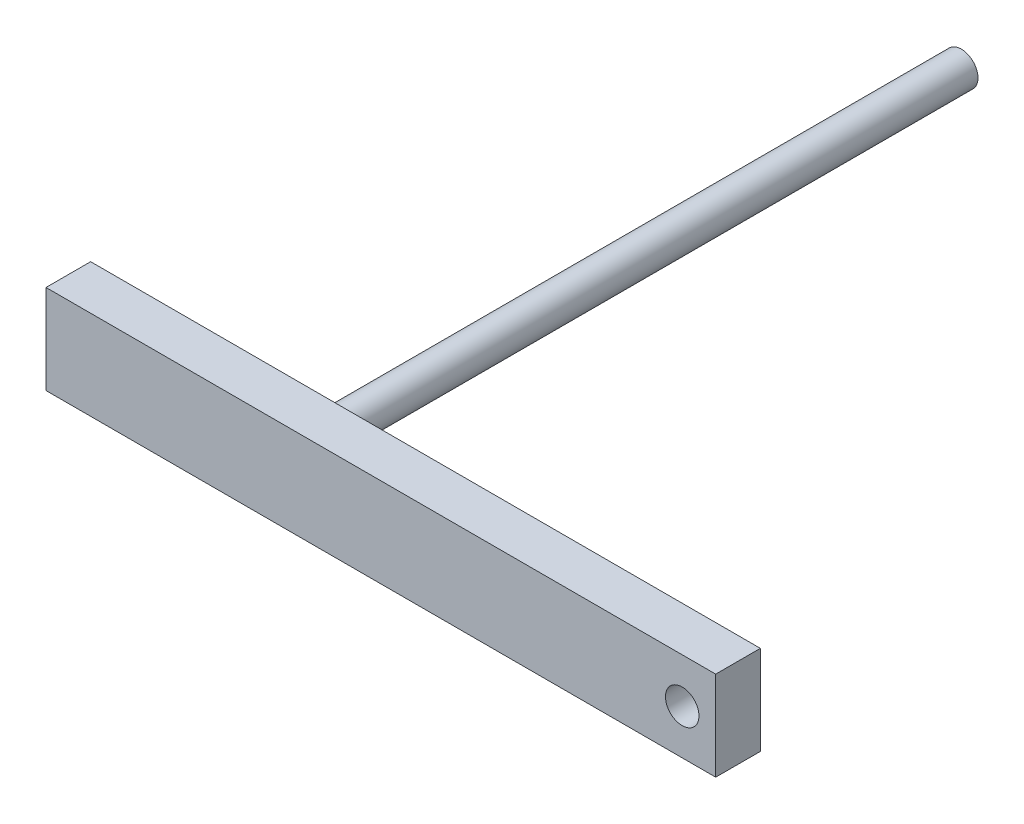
ISO-10303-21;
HEADER;
FILE_DESCRIPTION(('STEP AP214'),'2;1');
FILE_NAME('part.step','',(''),(''),'','','');
FILE_SCHEMA(('AUTOMOTIVE_DESIGN { 1 0 10303 214 1 1 1 1 }'));
ENDSEC;
DATA;
#1=APPLICATION_CONTEXT('core data for automotive mechanical design processes');
#2=APPLICATION_PROTOCOL_DEFINITION('international standard','automotive_design',2000,#1);
#3=PRODUCT_CONTEXT('',#1,'mechanical');
#4=PRODUCT('Part','Part','',(#3));
#5=PRODUCT_RELATED_PRODUCT_CATEGORY('part','',(#4));
#6=PRODUCT_DEFINITION_FORMATION('','',#4);
#7=PRODUCT_DEFINITION_CONTEXT('part definition',#1,'design');
#8=PRODUCT_DEFINITION('design','',#6,#7);
#9=PRODUCT_DEFINITION_SHAPE('','',#8);
#10=(LENGTH_UNIT() NAMED_UNIT(*) SI_UNIT(.MILLI.,.METRE.));
#11=(NAMED_UNIT(*) PLANE_ANGLE_UNIT() SI_UNIT($,.RADIAN.));
#12=(NAMED_UNIT(*) SI_UNIT($,.STERADIAN.) SOLID_ANGLE_UNIT());
#13=UNCERTAINTY_MEASURE_WITH_UNIT(LENGTH_MEASURE(1.E-05),#10,'distance_accuracy_value','');
#14=(GEOMETRIC_REPRESENTATION_CONTEXT(3) GLOBAL_UNCERTAINTY_ASSIGNED_CONTEXT((#13)) GLOBAL_UNIT_ASSIGNED_CONTEXT((#10,
#11,#12)) REPRESENTATION_CONTEXT('',''));
#15=CARTESIAN_POINT('',(0.,0.,0.));
#16=DIRECTION('',(0.,0.,1.));
#17=DIRECTION('',(1.,0.,0.));
#18=AXIS2_PLACEMENT_3D('',#15,#16,#17);
#19=CARTESIAN_POINT('',(29.9999999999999,-4.,4.));
#20=DIRECTION('',(-1.,0.,0.));
#21=DIRECTION('',(0.,0.,1.));
#22=AXIS2_PLACEMENT_3D('',#19,#20,#21);
#23=PLANE('',#22);
#24=DIRECTION('',(0.,1.,0.));
#25=VECTOR('',#24,1.);
#26=CARTESIAN_POINT('',(29.9999999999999,-4.,0.));
#27=LINE('',#26,#25);
#28=CARTESIAN_POINT('',(29.9999999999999,-4.,0.));
#29=VERTEX_POINT('',#28);
#30=CARTESIAN_POINT('',(29.9999999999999,4.,0.));
#31=VERTEX_POINT('',#30);
#32=EDGE_CURVE('E106',#29,#31,#27,.T.);
#33=ORIENTED_EDGE('',*,*,#32,.T.);
#34=DIRECTION('',(0.,0.,-1.));
#35=VECTOR('',#34,1.);
#36=CARTESIAN_POINT('',(29.9999999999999,4.,4.));
#37=LINE('',#36,#35);
#38=CARTESIAN_POINT('',(29.9999999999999,4.,4.));
#39=VERTEX_POINT('',#38);
#40=EDGE_CURVE('E11',#39,#31,#37,.T.);
#41=ORIENTED_EDGE('',*,*,#40,.F.);
#42=DIRECTION('',(0.,1.,0.));
#43=VECTOR('',#42,1.);
#44=CARTESIAN_POINT('',(29.9999999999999,-4.,4.));
#45=LINE('',#44,#43);
#46=CARTESIAN_POINT('',(29.9999999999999,-4.,4.));
#47=VERTEX_POINT('',#46);
#48=EDGE_CURVE('E90',#47,#39,#45,.T.);
#49=ORIENTED_EDGE('',*,*,#48,.F.);
#50=DIRECTION('',(0.,0.,-1.));
#51=VECTOR('',#50,1.);
#52=CARTESIAN_POINT('',(29.9999999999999,-4.,4.));
#53=LINE('',#52,#51);
#54=EDGE_CURVE('E102',#47,#29,#53,.T.);
#55=ORIENTED_EDGE('',*,*,#54,.T.);
#56=EDGE_LOOP('',(#33,#41,#49,#55));
#57=FACE_BOUND('',#56,.T.);
#58=ADVANCED_FACE('F38',(#57),#23,.F.);
#59=CARTESIAN_POINT('',(-30.0000000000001,4.,4.));
#60=DIRECTION('',(0.,-1.,0.));
#61=DIRECTION('',(0.,0.,-1.));
#62=AXIS2_PLACEMENT_3D('',#59,#60,#61);
#63=PLANE('',#62);
#64=DIRECTION('',(-1.,0.,0.));
#65=VECTOR('',#64,1.);
#66=CARTESIAN_POINT('',(-30.0000000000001,4.,0.));
#67=LINE('',#66,#65);
#68=CARTESIAN_POINT('',(-30.0000000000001,4.,0.));
#69=VERTEX_POINT('',#68);
#70=EDGE_CURVE('E95',#31,#69,#67,.T.);
#71=ORIENTED_EDGE('',*,*,#70,.T.);
#72=DIRECTION('',(0.,0.,-1.));
#73=VECTOR('',#72,1.);
#74=CARTESIAN_POINT('',(-30.0000000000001,4.,4.));
#75=LINE('',#74,#73);
#76=CARTESIAN_POINT('',(-30.0000000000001,4.,4.));
#77=VERTEX_POINT('',#76);
#78=EDGE_CURVE('E47',#77,#69,#75,.T.);
#79=ORIENTED_EDGE('',*,*,#78,.F.);
#80=DIRECTION('',(-1.,0.,0.));
#81=VECTOR('',#80,1.);
#82=CARTESIAN_POINT('',(-30.0000000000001,4.,4.));
#83=LINE('',#82,#81);
#84=EDGE_CURVE('E85',#39,#77,#83,.T.);
#85=ORIENTED_EDGE('',*,*,#84,.F.);
#86=ORIENTED_EDGE('',*,*,#40,.T.);
#87=EDGE_LOOP('',(#71,#79,#85,#86));
#88=FACE_BOUND('',#87,.T.);
#89=ADVANCED_FACE('F94',(#88),#63,.F.);
#90=CARTESIAN_POINT('',(-30.0000000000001,-4.,4.));
#91=DIRECTION('',(1.,0.,0.));
#92=DIRECTION('',(0.,0.,-1.));
#93=AXIS2_PLACEMENT_3D('',#90,#91,#92);
#94=PLANE('',#93);
#95=DIRECTION('',(0.,-1.,0.));
#96=VECTOR('',#95,1.);
#97=CARTESIAN_POINT('',(-30.0000000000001,-4.,0.));
#98=LINE('',#97,#96);
#99=CARTESIAN_POINT('',(-30.0000000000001,-4.,0.));
#100=VERTEX_POINT('',#99);
#101=EDGE_CURVE('E72',#69,#100,#98,.T.);
#102=ORIENTED_EDGE('',*,*,#101,.T.);
#103=DIRECTION('',(0.,0.,-1.));
#104=VECTOR('',#103,1.);
#105=CARTESIAN_POINT('',(-30.0000000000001,-4.,4.));
#106=LINE('',#105,#104);
#107=CARTESIAN_POINT('',(-30.0000000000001,-4.,4.));
#108=VERTEX_POINT('',#107);
#109=EDGE_CURVE('E97',#108,#100,#106,.T.);
#110=ORIENTED_EDGE('',*,*,#109,.F.);
#111=DIRECTION('',(0.,-1.,0.));
#112=VECTOR('',#111,1.);
#113=CARTESIAN_POINT('',(-30.0000000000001,-4.,4.));
#114=LINE('',#113,#112);
#115=EDGE_CURVE('E88',#77,#108,#114,.T.);
#116=ORIENTED_EDGE('',*,*,#115,.F.);
#117=ORIENTED_EDGE('',*,*,#78,.T.);
#118=EDGE_LOOP('',(#102,#110,#116,#117));
#119=FACE_BOUND('',#118,.T.);
#120=ADVANCED_FACE('F98',(#119),#94,.F.);
#121=CARTESIAN_POINT('',(-30.0000000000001,-4.,4.));
#122=DIRECTION('',(0.,1.,0.));
#123=DIRECTION('',(0.,0.,1.));
#124=AXIS2_PLACEMENT_3D('',#121,#122,#123);
#125=PLANE('',#124);
#126=DIRECTION('',(1.,0.,0.));
#127=VECTOR('',#126,1.);
#128=CARTESIAN_POINT('',(-30.0000000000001,-4.,0.));
#129=LINE('',#128,#127);
#130=EDGE_CURVE('E78',#100,#29,#129,.T.);
#131=ORIENTED_EDGE('',*,*,#130,.T.);
#132=ORIENTED_EDGE('',*,*,#54,.F.);
#133=DIRECTION('',(1.,0.,0.));
#134=VECTOR('',#133,1.);
#135=CARTESIAN_POINT('',(-30.0000000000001,-4.,4.));
#136=LINE('',#135,#134);
#137=EDGE_CURVE('E55',#108,#47,#136,.T.);
#138=ORIENTED_EDGE('',*,*,#137,.F.);
#139=ORIENTED_EDGE('',*,*,#109,.T.);
#140=EDGE_LOOP('',(#131,#132,#138,#139));
#141=FACE_BOUND('',#140,.T.);
#142=ADVANCED_FACE('F120',(#141),#125,.F.);
#143=CARTESIAN_POINT('',(0.,0.,4.));
#144=DIRECTION('',(0.,0.,-1.));
#145=DIRECTION('',(-1.,0.,0.));
#146=AXIS2_PLACEMENT_3D('',#143,#144,#145);
#147=PLANE('',#146);
#148=CARTESIAN_POINT('',(26.9999999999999,0.,4.));
#149=DIRECTION('',(0.,0.,-1.));
#150=DIRECTION('',(-1.,0.,0.));
#151=AXIS2_PLACEMENT_3D('',#148,#149,#150);
#152=CIRCLE('',#151,1.5);
#153=CARTESIAN_POINT('',(25.4999999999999,0.,4.));
#154=VERTEX_POINT('',#153);
#155=EDGE_CURVE('E131',#154,#154,#152,.T.);
#156=ORIENTED_EDGE('',*,*,#155,.T.);
#157=EDGE_LOOP('',(#156));
#158=FACE_BOUND('',#157,.T.);
#159=ORIENTED_EDGE('',*,*,#48,.T.);
#160=ORIENTED_EDGE('',*,*,#84,.T.);
#161=ORIENTED_EDGE('',*,*,#115,.T.);
#162=ORIENTED_EDGE('',*,*,#137,.T.);
#163=EDGE_LOOP('',(#159,#160,#161,#162));
#164=FACE_BOUND('',#163,.T.);
#165=ADVANCED_FACE('F86',(#158,#164),#147,.F.);
#166=CARTESIAN_POINT('',(0.,0.,0.));
#167=DIRECTION('',(0.,0.,-1.));
#168=DIRECTION('',(-1.,0.,0.));
#169=AXIS2_PLACEMENT_3D('',#166,#167,#168);
#170=PLANE('',#169);
#171=CARTESIAN_POINT('',(26.9999999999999,0.,0.));
#172=DIRECTION('',(0.,0.,-1.));
#173=DIRECTION('',(-1.,0.,0.));
#174=AXIS2_PLACEMENT_3D('',#171,#172,#173);
#175=CIRCLE('',#174,1.5);
#176=CARTESIAN_POINT('',(25.4999999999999,0.,0.));
#177=VERTEX_POINT('',#176);
#178=EDGE_CURVE('E135',#177,#177,#175,.T.);
#179=ORIENTED_EDGE('',*,*,#178,.F.);
#180=EDGE_LOOP('',(#179));
#181=FACE_BOUND('',#180,.T.);
#182=CARTESIAN_POINT('',(-10.0000000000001,0.,0.));
#183=DIRECTION('',(0.,0.,-1.));
#184=DIRECTION('',(-1.,0.,0.));
#185=AXIS2_PLACEMENT_3D('',#182,#183,#184);
#186=CIRCLE('',#185,1.5);
#187=CARTESIAN_POINT('',(-8.50000000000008,0.,0.));
#188=VERTEX_POINT('',#187);
#189=EDGE_CURVE('E127',#188,#188,#186,.T.);
#190=ORIENTED_EDGE('',*,*,#189,.F.);
#191=EDGE_LOOP('',(#190));
#192=FACE_BOUND('',#191,.T.);
#193=ORIENTED_EDGE('',*,*,#32,.F.);
#194=ORIENTED_EDGE('',*,*,#130,.F.);
#195=ORIENTED_EDGE('',*,*,#101,.F.);
#196=ORIENTED_EDGE('',*,*,#70,.F.);
#197=EDGE_LOOP('',(#193,#194,#195,#196));
#198=FACE_BOUND('',#197,.T.);
#199=ADVANCED_FACE('F123',(#181,#192,#198),#170,.T.);
#200=CARTESIAN_POINT('',(-10.0000000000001,0.,-58.));
#201=DIRECTION('',(0.,0.,1.));
#202=DIRECTION('',(1.,0.,0.));
#203=AXIS2_PLACEMENT_3D('',#200,#201,#202);
#204=CYLINDRICAL_SURFACE('',#203,1.5);
#205=CARTESIAN_POINT('',(-10.0000000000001,0.,-58.));
#206=DIRECTION('',(0.,0.,-1.));
#207=DIRECTION('',(-1.,0.,0.));
#208=AXIS2_PLACEMENT_3D('',#205,#206,#207);
#209=CIRCLE('',#208,1.5);
#210=CARTESIAN_POINT('',(-8.50000000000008,0.,-58.));
#211=VERTEX_POINT('',#210);
#212=EDGE_CURVE('E110',#211,#211,#209,.T.);
#213=CARTESIAN_POINT('',(-8.50000000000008,0.,-58.));
#214=CARTESIAN_POINT('',(-8.50000000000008,0.,-57.3958333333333));
#215=CARTESIAN_POINT('',(-8.50000000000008,0.,-56.7916666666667));
#216=CARTESIAN_POINT('',(-8.50000000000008,0.,-55.5833333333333));
#217=CARTESIAN_POINT('',(-8.50000000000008,0.,-54.9791666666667));
#218=CARTESIAN_POINT('',(-8.50000000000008,0.,-53.7708333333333));
#219=CARTESIAN_POINT('',(-8.50000000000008,0.,-53.1666666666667));
#220=CARTESIAN_POINT('',(-8.50000000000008,0.,-51.9583333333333));
#221=CARTESIAN_POINT('',(-8.50000000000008,0.,-51.3541666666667));
#222=CARTESIAN_POINT('',(-8.50000000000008,0.,-50.1458333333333));
#223=CARTESIAN_POINT('',(-8.50000000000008,0.,-49.5416666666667));
#224=CARTESIAN_POINT('',(-8.50000000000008,0.,-48.3333333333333));
#225=CARTESIAN_POINT('',(-8.50000000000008,0.,-47.7291666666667));
#226=CARTESIAN_POINT('',(-8.50000000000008,0.,-46.5208333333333));
#227=CARTESIAN_POINT('',(-8.50000000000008,0.,-45.9166666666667));
#228=CARTESIAN_POINT('',(-8.50000000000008,0.,-44.7083333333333));
#229=CARTESIAN_POINT('',(-8.50000000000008,0.,-44.1041666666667));
#230=CARTESIAN_POINT('',(-8.50000000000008,0.,-42.8958333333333));
#231=CARTESIAN_POINT('',(-8.50000000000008,0.,-42.2916666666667));
#232=CARTESIAN_POINT('',(-8.50000000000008,0.,-41.0833333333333));
#233=CARTESIAN_POINT('',(-8.50000000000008,0.,-40.4791666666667));
#234=CARTESIAN_POINT('',(-8.50000000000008,0.,-39.2708333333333));
#235=CARTESIAN_POINT('',(-8.50000000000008,0.,-38.6666666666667));
#236=CARTESIAN_POINT('',(-8.50000000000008,0.,-37.4583333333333));
#237=CARTESIAN_POINT('',(-8.50000000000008,0.,-36.8541666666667));
#238=CARTESIAN_POINT('',(-8.50000000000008,0.,-35.6458333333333));
#239=CARTESIAN_POINT('',(-8.50000000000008,0.,-35.0416666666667));
#240=CARTESIAN_POINT('',(-8.50000000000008,0.,-33.8333333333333));
#241=CARTESIAN_POINT('',(-8.50000000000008,0.,-33.2291666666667));
#242=CARTESIAN_POINT('',(-8.50000000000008,0.,-32.0208333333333));
#243=CARTESIAN_POINT('',(-8.50000000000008,0.,-31.4166666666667));
#244=CARTESIAN_POINT('',(-8.50000000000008,0.,-30.2083333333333));
#245=CARTESIAN_POINT('',(-8.50000000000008,0.,-29.6041666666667));
#246=CARTESIAN_POINT('',(-8.50000000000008,0.,-28.3958333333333));
#247=CARTESIAN_POINT('',(-8.50000000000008,0.,-27.7916666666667));
#248=CARTESIAN_POINT('',(-8.50000000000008,0.,-26.5833333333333));
#249=CARTESIAN_POINT('',(-8.50000000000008,0.,-25.9791666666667));
#250=CARTESIAN_POINT('',(-8.50000000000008,0.,-24.7708333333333));
#251=CARTESIAN_POINT('',(-8.50000000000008,0.,-24.1666666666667));
#252=CARTESIAN_POINT('',(-8.50000000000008,0.,-22.9583333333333));
#253=CARTESIAN_POINT('',(-8.50000000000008,0.,-22.3541666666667));
#254=CARTESIAN_POINT('',(-8.50000000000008,0.,-21.1458333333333));
#255=CARTESIAN_POINT('',(-8.50000000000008,0.,-20.5416666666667));
#256=CARTESIAN_POINT('',(-8.50000000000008,0.,-19.3333333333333));
#257=CARTESIAN_POINT('',(-8.50000000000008,0.,-18.7291666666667));
#258=CARTESIAN_POINT('',(-8.50000000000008,0.,-17.5208333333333));
#259=CARTESIAN_POINT('',(-8.50000000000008,0.,-16.9166666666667));
#260=CARTESIAN_POINT('',(-8.50000000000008,0.,-15.7083333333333));
#261=CARTESIAN_POINT('',(-8.50000000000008,0.,-15.1041666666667));
#262=CARTESIAN_POINT('',(-8.50000000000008,0.,-13.8958333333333));
#263=CARTESIAN_POINT('',(-8.50000000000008,0.,-13.2916666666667));
#264=CARTESIAN_POINT('',(-8.50000000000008,0.,-12.0833333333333));
#265=CARTESIAN_POINT('',(-8.50000000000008,0.,-11.4791666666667));
#266=CARTESIAN_POINT('',(-8.50000000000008,0.,-10.2708333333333));
#267=CARTESIAN_POINT('',(-8.50000000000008,0.,-9.66666666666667));
#268=CARTESIAN_POINT('',(-8.50000000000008,0.,-8.45833333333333));
#269=CARTESIAN_POINT('',(-8.50000000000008,0.,-7.85416666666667));
#270=CARTESIAN_POINT('',(-8.50000000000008,0.,-6.64583333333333));
#271=CARTESIAN_POINT('',(-8.50000000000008,0.,-6.04166666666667));
#272=CARTESIAN_POINT('',(-8.50000000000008,0.,-4.83333333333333));
#273=CARTESIAN_POINT('',(-8.50000000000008,0.,-4.22916666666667));
#274=CARTESIAN_POINT('',(-8.50000000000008,0.,-3.02083333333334));
#275=CARTESIAN_POINT('',(-8.50000000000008,0.,-2.41666666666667));
#276=CARTESIAN_POINT('',(-8.50000000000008,0.,-1.20833333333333));
#277=CARTESIAN_POINT('',(-8.50000000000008,0.,-0.604166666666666));
#278=CARTESIAN_POINT('',(-8.50000000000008,0.,0.));
#279=B_SPLINE_CURVE_WITH_KNOTS('',3,(#213,#214,#215,#216,#217,#218,#219,#220,#221,#222,#223,
#224,#225,#226,#227,#228,#229,#230,#231,#232,#233,#234,#235,#236,#237,#238,#239,#240,#241,#242,
#243,#244,#245,#246,#247,#248,#249,#250,#251,#252,#253,#254,#255,#256,#257,#258,#259,#260,#261,
#262,#263,#264,#265,#266,#267,#268,#269,#270,#271,#272,#273,#274,#275,#276,#277,#278),
.UNSPECIFIED.,.F.,.F.,(4,2,2,2,2,2,2,2,2,2,2,2,2,2,2,2,2,2,2,2,2,2,2,2,2,2,2,2,2,2,2,2,4),(0.,
1.81249999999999,3.625,5.4375,7.24999999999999,9.06249999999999,10.875,12.6875,14.5,16.3125,
18.125,19.9375,21.75,23.5625,25.375,27.1875,29.,30.8125,32.625,34.4375,36.25,38.0625,39.875,
41.6875,43.5,45.3125,47.125,48.9375,50.75,52.5625,54.375,56.1875,58.),.UNSPECIFIED.);
#280=EDGE_CURVE('BSEAM153',#211,#188,#279,.T.);
#281=ORIENTED_EDGE('',*,*,#212,.F.);
#282=ORIENTED_EDGE('',*,*,#189,.T.);
#283=ORIENTED_EDGE('',*,*,#280,.T.);
#284=ORIENTED_EDGE('',*,*,#280,.F.);
#285=EDGE_LOOP('',(#281,#283,#282,#284));
#286=FACE_BOUND('',#285,.T.);
#287=ADVANCED_FACE('F153',(#286),#204,.T.);
#288=CARTESIAN_POINT('',(-10.0000000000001,0.,-58.));
#289=DIRECTION('',(0.,0.,-1.));
#290=DIRECTION('',(-1.,0.,0.));
#291=AXIS2_PLACEMENT_3D('',#288,#289,#290);
#292=PLANE('',#291);
#293=ORIENTED_EDGE('',*,*,#212,.T.);
#294=EDGE_LOOP('',(#293));
#295=FACE_BOUND('',#294,.T.);
#296=ADVANCED_FACE('F147',(#295),#292,.T.);
#297=CARTESIAN_POINT('',(26.9999999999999,0.,4.));
#298=DIRECTION('',(0.,0.,-1.));
#299=DIRECTION('',(-1.,0.,0.));
#300=AXIS2_PLACEMENT_3D('',#297,#298,#299);
#301=CYLINDRICAL_SURFACE('',#300,1.5);
#302=ORIENTED_EDGE('',*,*,#155,.F.);
#303=EDGE_LOOP('',(#302));
#304=FACE_BOUND('',#303,.T.);
#305=ORIENTED_EDGE('',*,*,#178,.T.);
#306=EDGE_LOOP('',(#305));
#307=FACE_BOUND('',#306,.T.);
#308=ADVANCED_FACE('F144',(#304,#307),#301,.F.);
#309=CLOSED_SHELL('',(#58,#89,#120,#142,#165,#199,#287,#296,#308));
#310=MANIFOLD_SOLID_BREP('B2',#309);
#311=ADVANCED_BREP_SHAPE_REPRESENTATION('',(#18,#310),#14);
#312=SHAPE_DEFINITION_REPRESENTATION(#9,#311);
ENDSEC;
END-ISO-10303-21;
